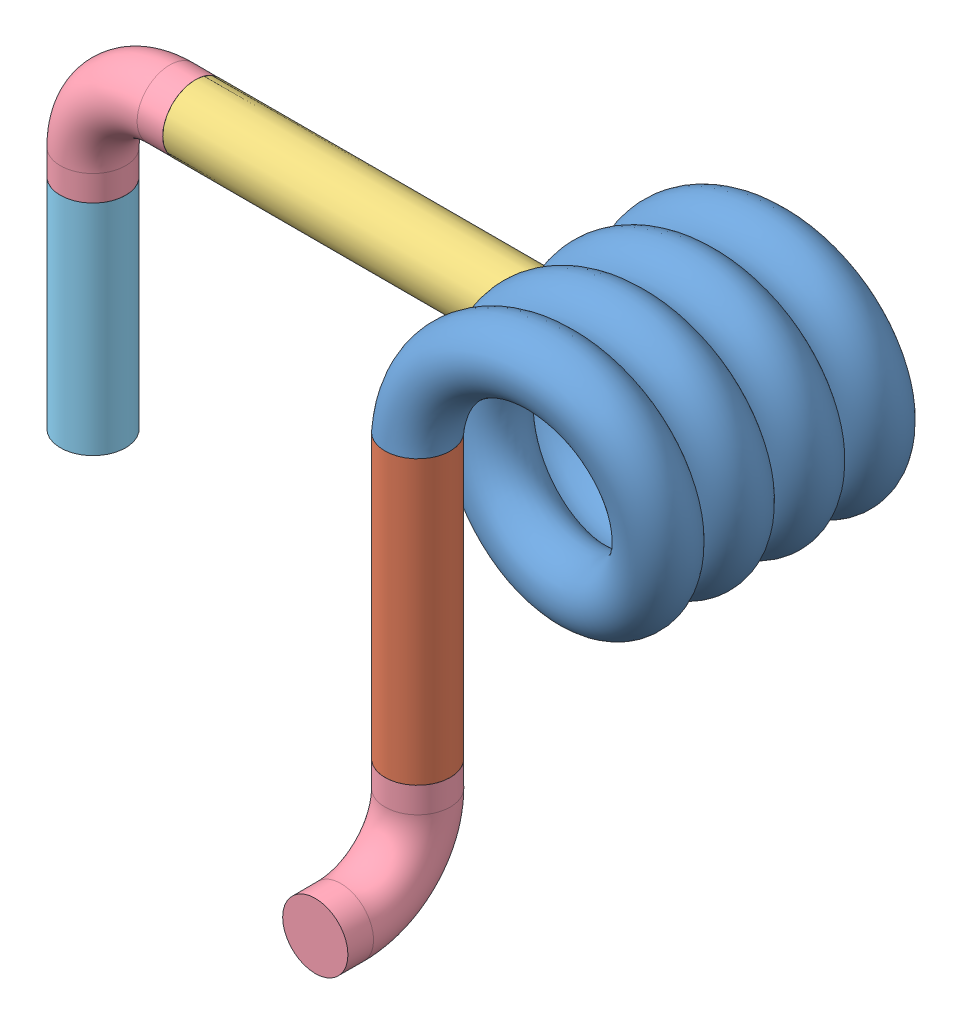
SolidWorks assembly 10-600057-100 Rev A.SLDASM, configuration Default (file format 10000). Lengths in mm.
Overall size (17.04 11.09 7.92).
6 component instances, 5 part files, 10 mates.
Components (placement in the parent):
- 15-600057-100 Rev A-1: 15-600057-100 Rev A.SLDPRT [Default] at (1.5104 5.9512 4.5652) size (5.36 5.36 6.53)
- 15-600057-102 Rev A-4: 15-600057-102 Rev A.SLDPRT [Default] at (-0.5216 5.9512 8.7562) x (1 0 0) z (0 -1 0) size (1.3 1.3 5.61)
- 15-600057-103 Rev A-1: 15-600057-103 Rev A.SLDPRT [Default] at (-10.1736 3.9192 3.5175) x (0 0 -1) z (1 0 0) size (1.3 1.3 11.68)
- 15-600057-101 Rev A-3: 15-600057-101 Rev A.SLDPRT [Default] at (-10.1736 3.9192 3.5175) x (1 0 0) z (0 0 1) size (2.68 2.68 1.3)
- 15-600057-104 Rev A-1: 15-600057-104 Rev A.SLDPRT [Default] at (-12.2056 1.8872 3.5175) x (1 0 0) z (0 -1 0) size (1.3 1.3 4.34)
- 15-600057-101 Rev A-4: 15-600057-101 Rev A.SLDPRT [Default] at (-0.5216 0.3378 8.7562) x (0 1 0) z (-1 0 0) size (2.68 2.68 1.3)
Mates (geometry in assembly coordinates):
- Coincident3: coincident anti-aligned: plane of 15-600057-100 Rev A-1 through (-0.5216 5.9512 8.1085) normal (0 -1 0); plane of 15-600057-102 Rev A-4 through (-0.5216 5.9512 8.7562) normal (0 1 0)
- Coincident4: coincident aligned: circle of 15-600057-100 Rev A-1; circle of 15-600057-102 Rev A-4
- Coincident7: coincident anti-aligned: plane of 15-600057-100 Rev A-1 through (1.5104 3.9192 2.8698) normal (-1 0 0); plane of 15-600057-103 Rev A-1 through (1.5104 3.9192 3.5175) normal (1 0 0)
- Coincident8: coincident anti-aligned: circle of 15-600057-100 Rev A-1; circle of 15-600057-103 Rev A-1
- Coincident9: coincident anti-aligned: plane of 15-600057-103 Rev A-1 through (-10.1736 3.9192 3.5175) normal (-1 0 0); plane of 15-600057-101 Rev A-3 through (-10.1736 3.9192 3.5175) normal (1 0 0)
- Coincident10: coincident aligned: circle of 15-600057-103 Rev A-1; circle of 15-600057-101 Rev A-3
- Coincident11: coincident anti-aligned: plane of 15-600057-101 Rev A-3 through (-12.2056 1.8872 3.5175) normal (0 -1 0); plane of 15-600057-104 Rev A-1 through (-12.2056 1.8872 3.5175) normal (0 1 0)
- Coincident12: coincident anti-aligned: circle of 15-600057-101 Rev A-3; circle of 15-600057-104 Rev A-1
- Coincident13: coincident anti-aligned: plane of 15-600057-102 Rev A-4 through (-0.5216 0.3378 8.7562) normal (0 -1 0); plane of 15-600057-101 Rev A-4 through (-0.5216 0.3378 8.7562) normal (0 1 0)
- Coincident14: coincident anti-aligned: circle of 15-600057-102 Rev A-4; circle of 15-600057-101 Rev A-4
